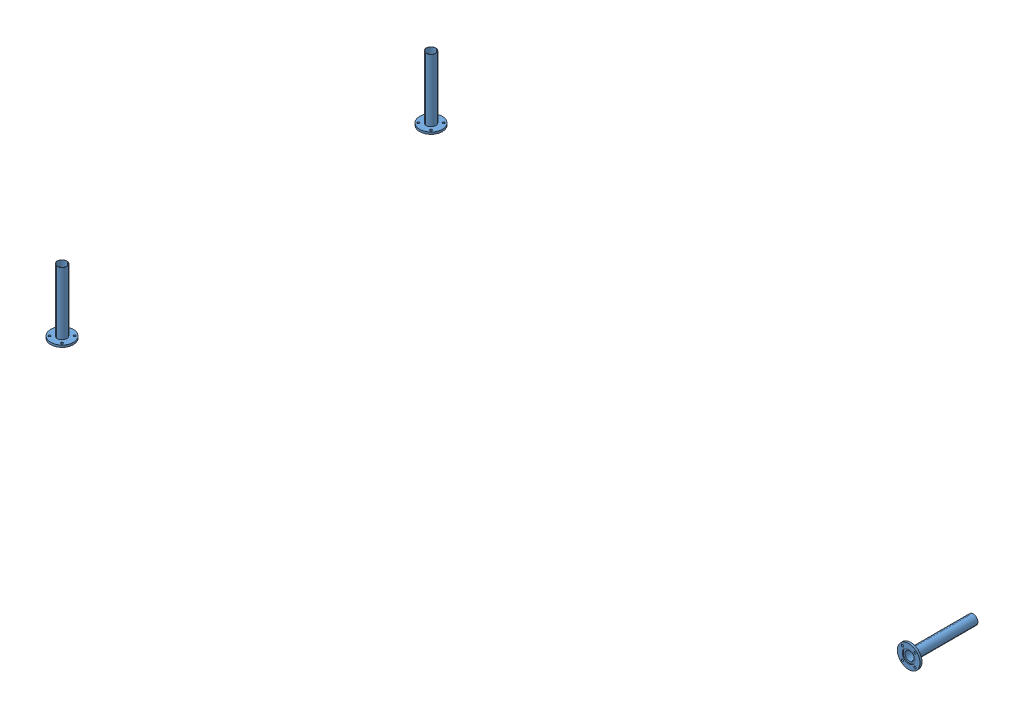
SolidWorks assembly Drains.SLDASM, configuration Default (file format 13000). Lengths in mm.
Overall size (2385 4100.5 5300.5).
3 component instances, 1 part files, 0 mates.
Components (placement in the parent):
- Equip_Flange-6: Equip_Flange.SLDPRT [Default] x (1 0 0) z (0 -1 0) size (185 185 524.5)
- Equip_Flange-7: Equip_Flange.SLDPRT [Default] at (0 0 -3000) x (1 0 0) z (0 -1 0) size (185 185 524.5)
- Equip_Flange-10: Equip_Flange.SLDPRT [Default] at (2200 -3500 -4700) size (185 185 524.5)
